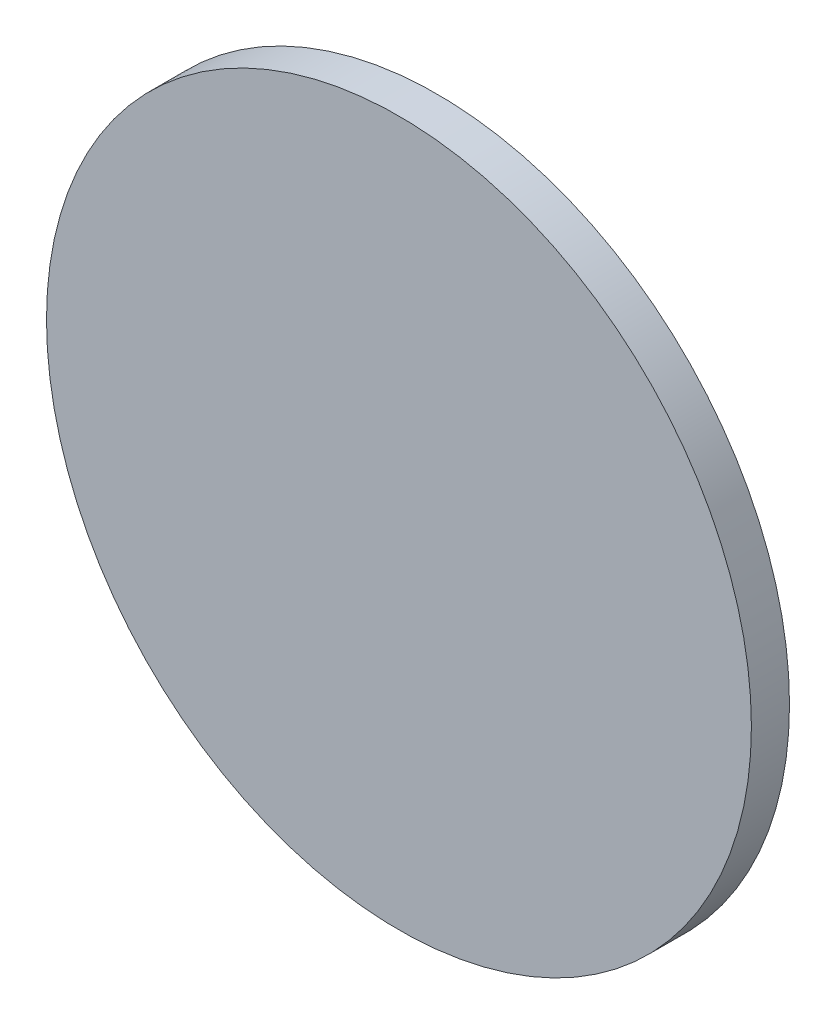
ISO-10303-21;
HEADER;
FILE_DESCRIPTION(('STEP AP214'),'2;1');
FILE_NAME('part.step','',(''),(''),'','','');
FILE_SCHEMA(('AUTOMOTIVE_DESIGN { 1 0 10303 214 1 1 1 1 }'));
ENDSEC;
DATA;
#1=APPLICATION_CONTEXT('core data for automotive mechanical design processes');
#2=APPLICATION_PROTOCOL_DEFINITION('international standard','automotive_design',2000,#1);
#3=PRODUCT_CONTEXT('',#1,'mechanical');
#4=PRODUCT('Part','Part','',(#3));
#5=PRODUCT_RELATED_PRODUCT_CATEGORY('part','',(#4));
#6=PRODUCT_DEFINITION_FORMATION('','',#4);
#7=PRODUCT_DEFINITION_CONTEXT('part definition',#1,'design');
#8=PRODUCT_DEFINITION('design','',#6,#7);
#9=PRODUCT_DEFINITION_SHAPE('','',#8);
#10=(LENGTH_UNIT() NAMED_UNIT(*) SI_UNIT(.MILLI.,.METRE.));
#11=(NAMED_UNIT(*) PLANE_ANGLE_UNIT() SI_UNIT($,.RADIAN.));
#12=(NAMED_UNIT(*) SI_UNIT($,.STERADIAN.) SOLID_ANGLE_UNIT());
#13=UNCERTAINTY_MEASURE_WITH_UNIT(LENGTH_MEASURE(1.E-05),#10,'distance_accuracy_value','');
#14=(GEOMETRIC_REPRESENTATION_CONTEXT(3) GLOBAL_UNCERTAINTY_ASSIGNED_CONTEXT((#13)) GLOBAL_UNIT_ASSIGNED_CONTEXT((#10,
#11,#12)) REPRESENTATION_CONTEXT('',''));
#15=CARTESIAN_POINT('',(0.,0.,0.));
#16=DIRECTION('',(0.,0.,1.));
#17=DIRECTION('',(1.,0.,0.));
#18=AXIS2_PLACEMENT_3D('',#15,#16,#17);
#19=CARTESIAN_POINT('',(601.5,-130.,-73.05));
#20=DIRECTION('',(-1.,0.,0.));
#21=DIRECTION('',(0.,0.,1.));
#22=AXIS2_PLACEMENT_3D('',#19,#20,#21);
#23=PLANE('',#22);
#24=DIRECTION('',(0.,0.,-1.));
#25=VECTOR('',#24,1.);
#26=CARTESIAN_POINT('',(601.5,-129.,-73.05));
#27=LINE('',#26,#25);
#28=CARTESIAN_POINT('',(601.5,-129.,-72.2817263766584));
#29=VERTEX_POINT('',#28);
#30=CARTESIAN_POINT('',(601.499999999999,-129.,-69.8999999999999));
#31=VERTEX_POINT('',#30);
#32=EDGE_CURVE('E92',#29,#31,#27,.F.);
#33=ORIENTED_EDGE('',*,*,#32,.F.);
#34=CARTESIAN_POINT('',(601.5,-129.,-72.2817263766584));
#35=CARTESIAN_POINT('',(601.5,-129.333333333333,-72.2900525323));
#36=CARTESIAN_POINT('',(601.5,-129.666666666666,-72.2942156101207));
#37=CARTESIAN_POINT('',(601.5,-130.333333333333,-72.2942156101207));
#38=CARTESIAN_POINT('',(601.5,-130.666666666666,-72.2900525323));
#39=CARTESIAN_POINT('',(601.5,-131.,-72.2817263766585));
#40=B_SPLINE_CURVE_WITH_KNOTS('',3,(#34,#35,#36,#37,#38,#39),.UNSPECIFIED.,.F.,.F.,(4,2,4),(0.,
1.00007798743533,2.00015597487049),.UNSPECIFIED.);
#41=CARTESIAN_POINT('',(601.5,-131.,-72.2817263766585));
#42=VERTEX_POINT('',#41);
#43=EDGE_CURVE('E161',#29,#42,#40,.T.);
#44=ORIENTED_EDGE('',*,*,#43,.T.);
#45=DIRECTION('',(0.,0.,1.));
#46=VECTOR('',#45,1.);
#47=CARTESIAN_POINT('',(601.5,-131.,-73.05));
#48=LINE('',#47,#46);
#49=CARTESIAN_POINT('',(601.5,-131.,-69.8999999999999));
#50=VERTEX_POINT('',#49);
#51=EDGE_CURVE('E75',#50,#42,#48,.F.);
#52=ORIENTED_EDGE('',*,*,#51,.F.);
#53=DIRECTION('',(0.,1.,0.));
#54=VECTOR('',#53,1.);
#55=CARTESIAN_POINT('',(601.5,-130.,-69.9));
#56=LINE('',#55,#54);
#57=EDGE_CURVE('E67',#31,#50,#56,.F.);
#58=ORIENTED_EDGE('',*,*,#57,.F.);
#59=EDGE_LOOP('',(#33,#44,#52,#58));
#60=FACE_BOUND('',#59,.T.);
#61=ADVANCED_FACE('F16',(#60),#23,.T.);
#62=CARTESIAN_POINT('',(589.,-130.,-69.9));
#63=DIRECTION('',(0.,0.,-1.));
#64=DIRECTION('',(-1.,0.,0.));
#65=AXIS2_PLACEMENT_3D('',#62,#63,#64);
#66=PLANE('',#65);
#67=DIRECTION('',(0.,1.,0.));
#68=VECTOR('',#67,1.);
#69=CARTESIAN_POINT('',(576.5,-130.,-69.8999999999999));
#70=LINE('',#69,#68);
#71=CARTESIAN_POINT('',(576.5,-129.,-69.8999999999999));
#72=VERTEX_POINT('',#71);
#73=CARTESIAN_POINT('',(576.5,-131.,-69.8999999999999));
#74=VERTEX_POINT('',#73);
#75=EDGE_CURVE('E57',#72,#74,#70,.F.);
#76=ORIENTED_EDGE('',*,*,#75,.F.);
#77=DIRECTION('',(1.,0.,0.));
#78=VECTOR('',#77,1.);
#79=CARTESIAN_POINT('',(589.,-129.,-69.8999999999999));
#80=LINE('',#79,#78);
#81=EDGE_CURVE('E89',#31,#72,#80,.F.);
#82=ORIENTED_EDGE('',*,*,#81,.F.);
#83=ORIENTED_EDGE('',*,*,#57,.T.);
#84=DIRECTION('',(1.,0.,0.));
#85=VECTOR('',#84,1.);
#86=CARTESIAN_POINT('',(589.,-131.,-69.8999999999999));
#87=LINE('',#86,#85);
#88=EDGE_CURVE('E70',#74,#50,#87,.T.);
#89=ORIENTED_EDGE('',*,*,#88,.F.);
#90=EDGE_LOOP('',(#76,#82,#83,#89));
#91=FACE_BOUND('',#90,.T.);
#92=ADVANCED_FACE('F71',(#91),#66,.T.);
#93=CARTESIAN_POINT('',(576.5,-130.,-73.0499999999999));
#94=DIRECTION('',(1.,0.,0.));
#95=DIRECTION('',(0.,0.,-1.));
#96=AXIS2_PLACEMENT_3D('',#93,#94,#95);
#97=PLANE('',#96);
#98=DIRECTION('',(0.,0.,1.));
#99=VECTOR('',#98,1.);
#100=CARTESIAN_POINT('',(576.5,-131.,-73.0499999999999));
#101=LINE('',#100,#99);
#102=CARTESIAN_POINT('',(576.5,-131.,-72.2817263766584));
#103=VERTEX_POINT('',#102);
#104=EDGE_CURVE('E61',#103,#74,#101,.T.);
#105=ORIENTED_EDGE('',*,*,#104,.F.);
#106=CARTESIAN_POINT('',(576.5,-131.,-72.2817263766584));
#107=CARTESIAN_POINT('',(576.5,-130.666666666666,-72.2900525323));
#108=CARTESIAN_POINT('',(576.5,-130.333333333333,-72.2942156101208));
#109=CARTESIAN_POINT('',(576.5,-129.666666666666,-72.2942156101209));
#110=CARTESIAN_POINT('',(576.5,-129.333333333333,-72.2900525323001));
#111=CARTESIAN_POINT('',(576.5,-129.,-72.2817263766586));
#112=B_SPLINE_CURVE_WITH_KNOTS('',3,(#106,#107,#108,#109,#110,#111),.UNSPECIFIED.,.F.,.F.,(4,2,
4),(0.,1.00007798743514,2.00015597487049),.UNSPECIFIED.);
#113=CARTESIAN_POINT('',(576.5,-129.,-72.2817263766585));
#114=VERTEX_POINT('',#113);
#115=EDGE_CURVE('E40',#103,#114,#112,.T.);
#116=ORIENTED_EDGE('',*,*,#115,.T.);
#117=DIRECTION('',(0.,0.,-1.));
#118=VECTOR('',#117,1.);
#119=CARTESIAN_POINT('',(576.5,-129.,-73.0499999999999));
#120=LINE('',#119,#118);
#121=EDGE_CURVE('E63',#72,#114,#120,.T.);
#122=ORIENTED_EDGE('',*,*,#121,.F.);
#123=ORIENTED_EDGE('',*,*,#75,.T.);
#124=EDGE_LOOP('',(#105,#116,#122,#123));
#125=FACE_BOUND('',#124,.T.);
#126=ADVANCED_FACE('F59',(#125),#97,.T.);
#127=CARTESIAN_POINT('',(589.,-131.,-73.05));
#128=DIRECTION('',(0.,1.,0.));
#129=DIRECTION('',(0.,0.,1.));
#130=AXIS2_PLACEMENT_3D('',#127,#128,#129);
#131=PLANE('',#130);
#132=ORIENTED_EDGE('',*,*,#88,.T.);
#133=ORIENTED_EDGE('',*,*,#51,.T.);
#134=CARTESIAN_POINT('',(576.5,-131.,-72.2817263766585));
#135=CARTESIAN_POINT('',(577.259636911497,-131.,-72.5189728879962));
#136=CARTESIAN_POINT('',(578.026038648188,-131.,-72.734544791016));
#137=CARTESIAN_POINT('',(579.56991982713,-131.,-73.1217677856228));
#138=CARTESIAN_POINT('',(580.347400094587,-131.,-73.2934155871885));
#139=CARTESIAN_POINT('',(581.91089896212,-131.,-73.5921882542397));
#140=CARTESIAN_POINT('',(582.696917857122,-131.,-73.7193115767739));
#141=CARTESIAN_POINT('',(584.255340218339,-131.,-73.9260265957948));
#142=CARTESIAN_POINT('',(585.027597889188,-131.,-74.0067189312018));
#143=CARTESIAN_POINT('',(586.575319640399,-131.,-74.1251146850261));
#144=CARTESIAN_POINT('',(587.350783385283,-131.,-74.1628224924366));
#145=CARTESIAN_POINT('',(588.902495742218,-131.,-74.1951430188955));
#146=CARTESIAN_POINT('',(589.678744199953,-131.,-74.1897630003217));
#147=CARTESIAN_POINT('',(591.071991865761,-131.,-74.1414206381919));
#148=CARTESIAN_POINT('',(591.689276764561,-131.,-74.1063228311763));
#149=CARTESIAN_POINT('',(592.921638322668,-131.,-74.0088781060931));
#150=CARTESIAN_POINT('',(593.536715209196,-131.,-73.9465340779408));
#151=CARTESIAN_POINT('',(594.763479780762,-131.,-73.7947224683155));
#152=CARTESIAN_POINT('',(595.375167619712,-131.,-73.7052561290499));
#153=CARTESIAN_POINT('',(596.606340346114,-131.,-73.4972884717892));
#154=CARTESIAN_POINT('',(597.225732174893,-131.,-73.3782357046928));
#155=CARTESIAN_POINT('',(598.4585587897,-131.,-73.1123077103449));
#156=CARTESIAN_POINT('',(599.071993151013,-131.,-72.9654305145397));
#157=CARTESIAN_POINT('',(600.291701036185,-131.,-72.6441474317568));
#158=CARTESIAN_POINT('',(600.897973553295,-131.,-72.469737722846));
#159=CARTESIAN_POINT('',(601.5,-131.,-72.2817263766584));
#160=B_SPLINE_CURVE_WITH_KNOTS('',3,(#134,#135,#136,#137,#138,#139,#140,#141,#142,#143,#144,
#145,#146,#147,#148,#149,#150,#151,#152,#153,#154,#155,#156,#157,#158,#159),.UNSPECIFIED.,.F.,
.F.,(4,2,2,2,2,2,2,2,2,2,2,2,4),(0.,2.3871401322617,4.77445901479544,7.16186061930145,
9.49005231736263,11.8180062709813,14.1455678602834,15.9998373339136,17.8539101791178,
19.7078981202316,21.5994422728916,23.4911203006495,25.3830611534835),.UNSPECIFIED.);
#161=EDGE_CURVE('E79',#103,#42,#160,.T.);
#162=ORIENTED_EDGE('',*,*,#161,.F.);
#163=ORIENTED_EDGE('',*,*,#104,.T.);
#164=EDGE_LOOP('',(#132,#133,#162,#163));
#165=FACE_BOUND('',#164,.T.);
#166=ADVANCED_FACE('F77',(#165),#131,.T.);
#167=CARTESIAN_POINT('',(589.,-129.,-73.05));
#168=DIRECTION('',(0.,-1.,0.));
#169=DIRECTION('',(0.,0.,-1.));
#170=AXIS2_PLACEMENT_3D('',#167,#168,#169);
#171=PLANE('',#170);
#172=ORIENTED_EDGE('',*,*,#81,.T.);
#173=ORIENTED_EDGE('',*,*,#121,.T.);
#174=CARTESIAN_POINT('',(601.5,-129.,-72.2817263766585));
#175=CARTESIAN_POINT('',(600.740363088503,-129.,-72.5189728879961));
#176=CARTESIAN_POINT('',(599.973961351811,-129.,-72.7345447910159));
#177=CARTESIAN_POINT('',(598.43008017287,-129.,-73.1217677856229));
#178=CARTESIAN_POINT('',(597.652599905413,-129.,-73.2934155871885));
#179=CARTESIAN_POINT('',(596.089101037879,-129.,-73.5921882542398));
#180=CARTESIAN_POINT('',(595.303082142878,-129.,-73.7193115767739));
#181=CARTESIAN_POINT('',(593.744659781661,-129.,-73.9260265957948));
#182=CARTESIAN_POINT('',(592.972402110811,-129.,-74.0067189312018));
#183=CARTESIAN_POINT('',(591.424680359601,-129.,-74.1251146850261));
#184=CARTESIAN_POINT('',(590.649216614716,-129.,-74.1628224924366));
#185=CARTESIAN_POINT('',(589.097504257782,-129.,-74.1951430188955));
#186=CARTESIAN_POINT('',(588.321255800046,-129.,-74.1897630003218));
#187=CARTESIAN_POINT('',(586.928008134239,-129.,-74.141420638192));
#188=CARTESIAN_POINT('',(586.310723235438,-129.,-74.1063228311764));
#189=CARTESIAN_POINT('',(585.078361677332,-129.,-74.0088781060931));
#190=CARTESIAN_POINT('',(584.463284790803,-129.,-73.9465340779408));
#191=CARTESIAN_POINT('',(583.236520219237,-129.,-73.7947224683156));
#192=CARTESIAN_POINT('',(582.624832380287,-129.,-73.70525612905));
#193=CARTESIAN_POINT('',(581.393659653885,-129.,-73.4972884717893));
#194=CARTESIAN_POINT('',(580.774267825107,-129.,-73.3782357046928));
#195=CARTESIAN_POINT('',(579.5414412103,-129.,-73.112307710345));
#196=CARTESIAN_POINT('',(578.928006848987,-129.,-72.9654305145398));
#197=CARTESIAN_POINT('',(577.708298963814,-129.,-72.644147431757));
#198=CARTESIAN_POINT('',(577.102026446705,-129.,-72.4697377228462));
#199=CARTESIAN_POINT('',(576.5,-129.,-72.2817263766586));
#200=B_SPLINE_CURVE_WITH_KNOTS('',3,(#174,#175,#176,#177,#178,#179,#180,#181,#182,#183,#184,
#185,#186,#187,#188,#189,#190,#191,#192,#193,#194,#195,#196,#197,#198,#199),.UNSPECIFIED.,.F.,
.F.,(4,2,2,2,2,2,2,2,2,2,2,2,4),(0.,2.38714013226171,4.77445901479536,7.16186061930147,
9.49005231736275,11.8180062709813,14.1455678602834,15.9998373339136,17.8539101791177,
19.7078981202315,21.5994422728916,23.4911203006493,25.3830611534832),.UNSPECIFIED.);
#201=EDGE_CURVE('E120',#29,#114,#200,.T.);
#202=ORIENTED_EDGE('',*,*,#201,.F.);
#203=ORIENTED_EDGE('',*,*,#32,.T.);
#204=EDGE_LOOP('',(#172,#173,#202,#203));
#205=FACE_BOUND('',#204,.T.);
#206=ADVANCED_FACE('F103',(#205),#171,.T.);
#207=CARTESIAN_POINT('',(589.,-130.,-32.253488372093));
#208=DIRECTION('',(0.0965575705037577,0.981007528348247,0.168228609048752));
#209=DIRECTION('',(0.965143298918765,-0.133590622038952,0.225059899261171));
#210=AXIS2_PLACEMENT_3D('',#207,#208,#209);
#211=SPHERICAL_SURFACE('',#210,41.946511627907);
#212=ORIENTED_EDGE('',*,*,#161,.T.);
#213=ORIENTED_EDGE('',*,*,#43,.F.);
#214=ORIENTED_EDGE('',*,*,#201,.T.);
#215=ORIENTED_EDGE('',*,*,#115,.F.);
#216=EDGE_LOOP('',(#212,#213,#214,#215));
#217=FACE_BOUND('',#216,.T.);
#218=CARTESIAN_POINT('',(589.,-130.,-69.9));
#219=DIRECTION('',(0.,0.,-1.));
#220=DIRECTION('',(-1.,0.,0.));
#221=AXIS2_PLACEMENT_3D('',#218,#219,#220);
#222=CIRCLE('',#221,18.5);
#223=CARTESIAN_POINT('',(570.5,-130.,-69.9));
#224=VERTEX_POINT('',#223);
#225=EDGE_CURVE('E31',#224,#224,#222,.F.);
#226=ORIENTED_EDGE('',*,*,#225,.F.);
#227=EDGE_LOOP('',(#226));
#228=FACE_BOUND('',#227,.T.);
#229=ADVANCED_FACE('F106',(#217,#228),#211,.T.);
#230=CARTESIAN_POINT('',(589.,-130.,-68.8999999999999));
#231=DIRECTION('',(0.,0.,-1.));
#232=DIRECTION('',(-1.,0.,0.));
#233=AXIS2_PLACEMENT_3D('',#230,#231,#232);
#234=CYLINDRICAL_SURFACE('',#233,18.5);
#235=ORIENTED_EDGE('',*,*,#225,.T.);
#236=EDGE_LOOP('',(#235));
#237=FACE_BOUND('',#236,.T.);
#238=CARTESIAN_POINT('',(589.,-130.,-67.8999999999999));
#239=DIRECTION('',(0.,0.,-1.));
#240=DIRECTION('',(-1.,0.,0.));
#241=AXIS2_PLACEMENT_3D('',#238,#239,#240);
#242=CIRCLE('',#241,18.5);
#243=CARTESIAN_POINT('',(570.5,-130.,-67.8999999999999));
#244=VERTEX_POINT('',#243);
#245=EDGE_CURVE('E11',#244,#244,#242,.F.);
#246=ORIENTED_EDGE('',*,*,#245,.F.);
#247=EDGE_LOOP('',(#246));
#248=FACE_BOUND('',#247,.T.);
#249=ADVANCED_FACE('F139',(#237,#248),#234,.T.);
#250=CARTESIAN_POINT('',(598.25,-130.,-67.8999999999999));
#251=DIRECTION('',(0.,0.,1.));
#252=DIRECTION('',(1.,0.,0.));
#253=AXIS2_PLACEMENT_3D('',#250,#251,#252);
#254=PLANE('',#253);
#255=ORIENTED_EDGE('',*,*,#245,.T.);
#256=EDGE_LOOP('',(#255));
#257=FACE_BOUND('',#256,.T.);
#258=ADVANCED_FACE('F18',(#257),#254,.T.);
#259=CLOSED_SHELL('',(#61,#92,#126,#166,#206,#229,#249,#258));
#260=MANIFOLD_SOLID_BREP('B1',#259);
#261=ADVANCED_BREP_SHAPE_REPRESENTATION('',(#18,#260),#14);
#262=SHAPE_DEFINITION_REPRESENTATION(#9,#261);
ENDSEC;
END-ISO-10303-21;
